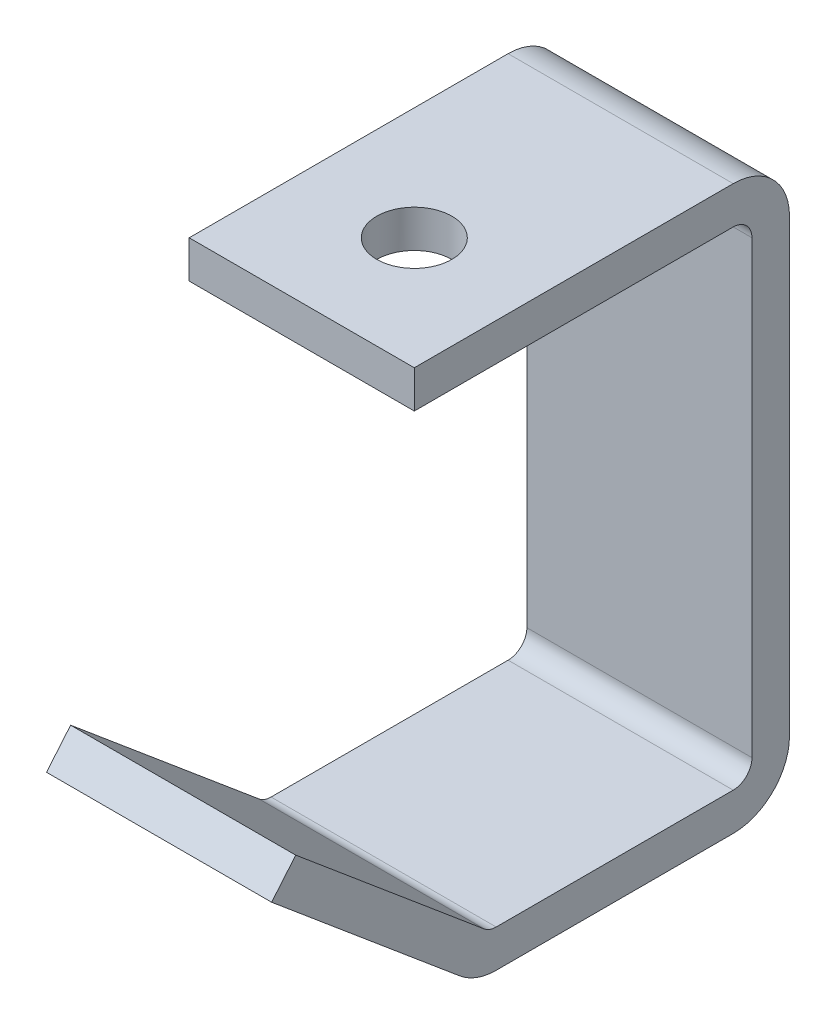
from build123d import *

# Parameters (mm, degrees)
BASE_EXTRUDE_THIN_DEPTH = 19.05
CUT_EXTRUDE1_REACH      = 128.668
SKETCH2_R               = 6.35


with BuildPart() as part:
    # Sketch1 → Base-Extrude-Thin (new, symmetric)
    with BuildSketch(Plane(origin=(0, 0, 0), x_dir=(0, 0, -1), z_dir=(1, 0, 0))):
        with BuildLine():
            Line((-77.216478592, 27.494340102), (-45.335245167, 0.742808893))
            ThreePointArc((-45.335245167, 0.742808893), (-44.380308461, 0.191475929), (-43.294394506, 0))
            Line((-43.294394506, 0), (-3.175, 0))
            ThreePointArc((-3.175, 0), (-0.92993597, 0.92993597), (0, 3.175))
            Line((0, 3.175), (0, 79.375))
            ThreePointArc((0, 79.375), (-0.92993597, 81.62006403), (-3.175, 82.55))
            Line((-3.175, 82.55), (-57.15, 82.55))
            Line((-57.15, 82.55), (-57.15, 88.9))
            Line((-57.15, 88.9), (-3.175, 88.9))
            ThreePointArc((-3.175, 88.9), (3.560192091, 86.110192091), (6.35, 79.375))
            Line((6.35, 79.375), (6.35, 3.175))
            ThreePointArc((6.35, 3.175), (3.560192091, -3.560192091), (-3.175, -6.35))
            Line((-3.175, -6.35), (-43.294394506, -6.35))
            ThreePointArc((-43.294394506, -6.35), (-46.552136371, -5.775572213), (-49.416946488, -4.121573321))
            Line((-49.416946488, -4.121573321), (-81.298179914, 22.629957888))
            Line((-81.298179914, 22.629957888), (-77.216478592, 27.494340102))
        make_face()
    extrude(amount=BASE_EXTRUDE_THIN_DEPTH, both=True)

    # Sketch2 → Cut-Extrude1 (cut, up to next)
    with BuildSketch(Plane(origin=(0, 88.9, 0), x_dir=(-1, 0, 0), z_dir=(0, 1, 0)), mode=Mode.PRIVATE) as cut_extrude1_sk1:
        with Locations(Location((0, 38.1, 0), (0, 0, 90))):
            Circle(SKETCH2_R)
    cut_extrude1_tool1 = extrude(cut_extrude1_sk1.sketch, amount=-CUT_EXTRUDE1_REACH, mode=Mode.PRIVATE) & part.part
    add(cut_extrude1_tool1.solids().sort_by_distance((0, 88.9, 38.1))[0], mode=Mode.SUBTRACT)


solid = part.part
